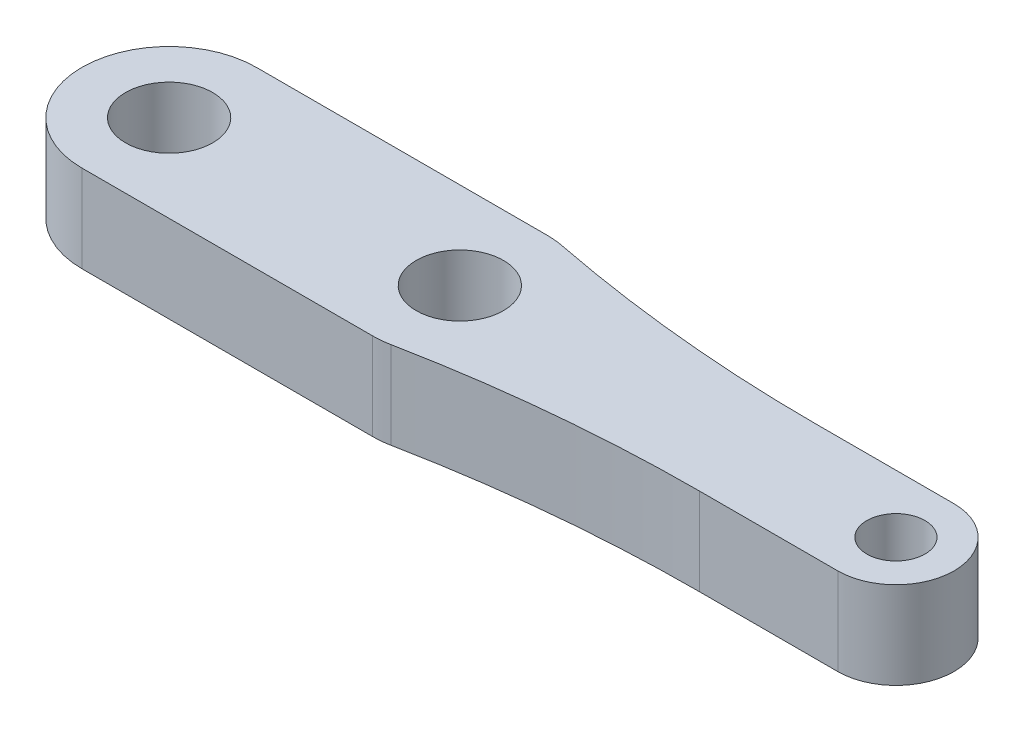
from build123d import *

# Parameters (mm, degrees)
SKETCH1_R           = 1
SKETCH1_R_2         = 1.5
BOSS_EXTRUDE1_DEPTH = 3
FILLET1_R           = 50


with BuildPart() as part:
    # Sketch1 → Boss-Extrude1 (new body)
    # profile 1 of 3: a face of its own
    with BuildSketch(Plane(origin=(0, 0, 0), x_dir=(1, 0, 0), z_dir=(0, 1, 0))):
        with BuildLine():
            Line((25, 2), (12.236067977, 2))
            ThreePointArc((12.236067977, 2), (13, 0), (12.236067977, -2))
            Line((12.236067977, -2), (25, -2))
            ThreePointArc((25, -2), (27, 0), (25, 2))
        make_face()
        with Locations(Location((25, 0, 0), (0, 0, 270))):
            Circle(SKETCH1_R, mode=Mode.SUBTRACT)
    # profile 2 of 3: a face of its own
    with BuildSketch(Plane(origin=(0, 0, 0), x_dir=(1, 0, 0), z_dir=(0, 1, 0))):
        with BuildLine():
            ThreePointArc((12.236067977, -2), (13, 0), (12.236067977, 2))
            Line((12.236067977, 2), (10, 2))
            ThreePointArc((10, 2), (8, 0), (10, -2))
            Line((10, -2), (12.236067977, -2))
        make_face()
        with Locations(Location((10, 0, 0), (0, 0, 270))):
            Circle(SKETCH1_R_2, mode=Mode.SUBTRACT)
    # profile 3 of 3: a face of its own
    with BuildSketch(Plane(origin=(0, 0, 0), x_dir=(1, 0, 0), z_dir=(0, 1, 0))):
        with BuildLine():
            Line((10, 3), (0, 3))
            ThreePointArc((0, 3), (-3, 0), (0, -3))
            Line((0, -3), (10, -3))
            ThreePointArc((10, -3), (11.224744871, -2.738612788), (12.236067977, -2))
            Line((12.236067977, -2), (10, -2))
            ThreePointArc((10, -2), (8, 0), (10, 2))
            Line((10, 2), (12.236067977, 2))
            ThreePointArc((12.236067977, 2), (11.224744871, 2.738612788), (10, 3))
        make_face()
        with Locations(Location((0, 0, 0), (0, 0, 270))):
            Circle(SKETCH1_R_2, mode=Mode.SUBTRACT)
    extrude(amount=BOSS_EXTRUDE1_DEPTH)

    # Fillet1
    fillet1_edges = [part.edges().sort_by_distance(p)[0] for p in [
        (12.236067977, 1.5, 2),
        (12.236067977, 1.5, -2),
    ]]
    fillet(fillet1_edges, radius=FILLET1_R)


solid = part.part
